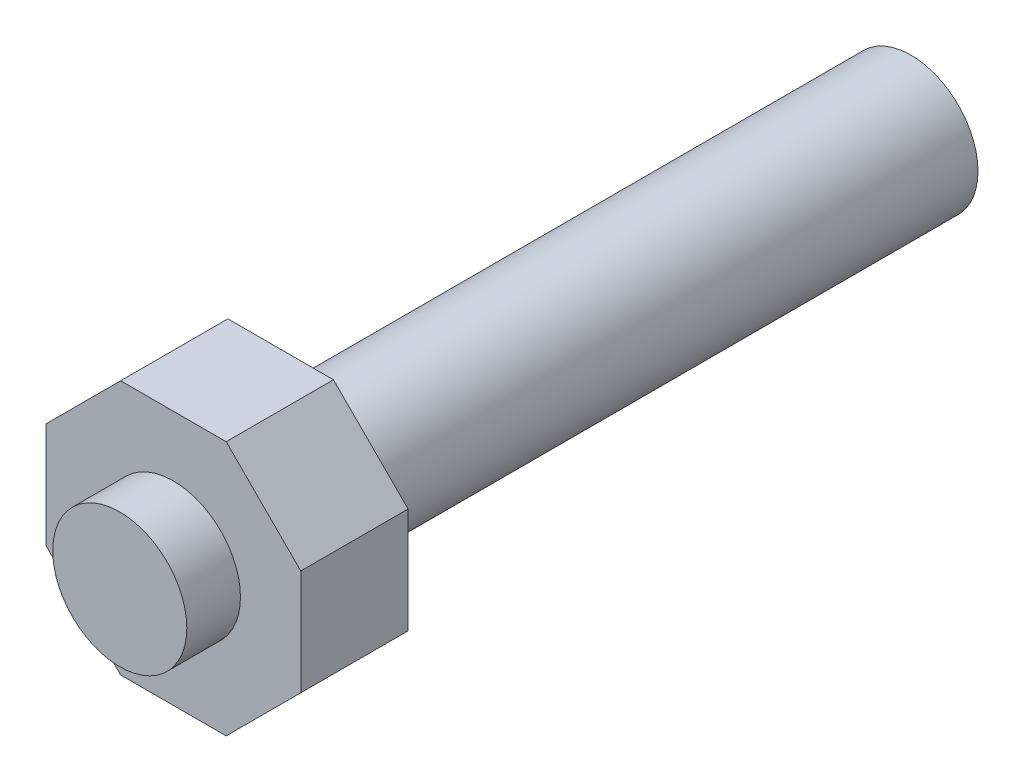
ISO-10303-21;
HEADER;
FILE_DESCRIPTION(('STEP AP214'),'2;1');
FILE_NAME('part.step','',(''),(''),'','','');
FILE_SCHEMA(('AUTOMOTIVE_DESIGN { 1 0 10303 214 1 1 1 1 }'));
ENDSEC;
DATA;
#1=APPLICATION_CONTEXT('core data for automotive mechanical design processes');
#2=APPLICATION_PROTOCOL_DEFINITION('international standard','automotive_design',2000,#1);
#3=PRODUCT_CONTEXT('',#1,'mechanical');
#4=PRODUCT('Part','Part','',(#3));
#5=PRODUCT_RELATED_PRODUCT_CATEGORY('part','',(#4));
#6=PRODUCT_DEFINITION_FORMATION('','',#4);
#7=PRODUCT_DEFINITION_CONTEXT('part definition',#1,'design');
#8=PRODUCT_DEFINITION('design','',#6,#7);
#9=PRODUCT_DEFINITION_SHAPE('','',#8);
#10=(LENGTH_UNIT() NAMED_UNIT(*) SI_UNIT(.MILLI.,.METRE.));
#11=(NAMED_UNIT(*) PLANE_ANGLE_UNIT() SI_UNIT($,.RADIAN.));
#12=(NAMED_UNIT(*) SI_UNIT($,.STERADIAN.) SOLID_ANGLE_UNIT());
#13=UNCERTAINTY_MEASURE_WITH_UNIT(LENGTH_MEASURE(1.E-05),#10,'distance_accuracy_value','');
#14=(GEOMETRIC_REPRESENTATION_CONTEXT(3) GLOBAL_UNCERTAINTY_ASSIGNED_CONTEXT((#13)) GLOBAL_UNIT_ASSIGNED_CONTEXT((#10,
#11,#12)) REPRESENTATION_CONTEXT('',''));
#15=CARTESIAN_POINT('',(0.,0.,0.));
#16=DIRECTION('',(0.,0.,1.));
#17=DIRECTION('',(1.,0.,0.));
#18=AXIS2_PLACEMENT_3D('',#15,#16,#17);
#19=CARTESIAN_POINT('',(5.,0.,47.));
#20=DIRECTION('',(0.,0.,1.));
#21=DIRECTION('',(1.,0.,0.));
#22=AXIS2_PLACEMENT_3D('',#19,#20,#21);
#23=PLANE('',#22);
#24=CARTESIAN_POINT('',(0.,0.,47.));
#25=DIRECTION('',(0.,0.,1.));
#26=DIRECTION('',(1.,0.,0.));
#27=AXIS2_PLACEMENT_3D('',#24,#25,#26);
#28=CIRCLE('',#27,5.);
#29=CARTESIAN_POINT('',(5.,0.,47.));
#30=VERTEX_POINT('',#29);
#31=EDGE_CURVE('E22',#30,#30,#28,.T.);
#32=ORIENTED_EDGE('',*,*,#31,.T.);
#33=EDGE_LOOP('',(#32));
#34=FACE_BOUND('',#33,.T.);
#35=DIRECTION('',(-0.707106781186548,-0.707106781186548,0.));
#36=VECTOR('',#35,1.);
#37=CARTESIAN_POINT('',(9.5,-3.9350288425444,47.));
#38=LINE('',#37,#36);
#39=CARTESIAN_POINT('',(9.5,-3.9350288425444,47.));
#40=VERTEX_POINT('',#39);
#41=CARTESIAN_POINT('',(3.9350288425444,-9.5,47.));
#42=VERTEX_POINT('',#41);
#43=EDGE_CURVE('E101',#40,#42,#38,.T.);
#44=ORIENTED_EDGE('',*,*,#43,.T.);
#45=DIRECTION('',(1.,0.,0.));
#46=VECTOR('',#45,1.);
#47=CARTESIAN_POINT('',(-3.9350288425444,-9.5,47.));
#48=LINE('',#47,#46);
#49=CARTESIAN_POINT('',(-3.9350288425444,-9.5,47.));
#50=VERTEX_POINT('',#49);
#51=EDGE_CURVE('E99',#50,#42,#48,.T.);
#52=ORIENTED_EDGE('',*,*,#51,.F.);
#53=DIRECTION('',(0.707106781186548,-0.707106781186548,0.));
#54=VECTOR('',#53,1.);
#55=CARTESIAN_POINT('',(-9.5,-3.9350288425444,47.));
#56=LINE('',#55,#54);
#57=CARTESIAN_POINT('',(-9.5,-3.9350288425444,47.));
#58=VERTEX_POINT('',#57);
#59=EDGE_CURVE('E29',#58,#50,#56,.T.);
#60=ORIENTED_EDGE('',*,*,#59,.F.);
#61=DIRECTION('',(0.,-1.,0.));
#62=VECTOR('',#61,1.);
#63=CARTESIAN_POINT('',(-9.5,3.9350288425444,47.));
#64=LINE('',#63,#62);
#65=CARTESIAN_POINT('',(-9.5,3.9350288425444,47.));
#66=VERTEX_POINT('',#65);
#67=EDGE_CURVE('E89',#66,#58,#64,.T.);
#68=ORIENTED_EDGE('',*,*,#67,.F.);
#69=DIRECTION('',(0.707106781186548,0.707106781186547,0.));
#70=VECTOR('',#69,1.);
#71=CARTESIAN_POINT('',(-9.5,3.9350288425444,47.));
#72=LINE('',#71,#70);
#73=CARTESIAN_POINT('',(-3.9350288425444,9.5,47.));
#74=VERTEX_POINT('',#73);
#75=EDGE_CURVE('E94',#66,#74,#72,.T.);
#76=ORIENTED_EDGE('',*,*,#75,.T.);
#77=DIRECTION('',(1.,0.,0.));
#78=VECTOR('',#77,1.);
#79=CARTESIAN_POINT('',(-3.9350288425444,9.5,47.));
#80=LINE('',#79,#78);
#81=CARTESIAN_POINT('',(3.9350288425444,9.5,47.));
#82=VERTEX_POINT('',#81);
#83=EDGE_CURVE('E216',#74,#82,#80,.T.);
#84=ORIENTED_EDGE('',*,*,#83,.T.);
#85=DIRECTION('',(0.707106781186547,-0.707106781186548,0.));
#86=VECTOR('',#85,1.);
#87=CARTESIAN_POINT('',(3.9350288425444,9.5,47.));
#88=LINE('',#87,#86);
#89=CARTESIAN_POINT('',(9.5,3.9350288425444,47.));
#90=VERTEX_POINT('',#89);
#91=EDGE_CURVE('E214',#82,#90,#88,.T.);
#92=ORIENTED_EDGE('',*,*,#91,.T.);
#93=DIRECTION('',(0.,-1.,0.));
#94=VECTOR('',#93,1.);
#95=CARTESIAN_POINT('',(9.5,3.9350288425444,47.));
#96=LINE('',#95,#94);
#97=EDGE_CURVE('E126',#90,#40,#96,.T.);
#98=ORIENTED_EDGE('',*,*,#97,.T.);
#99=EDGE_LOOP('',(#44,#52,#60,#68,#76,#84,#92,#98));
#100=FACE_BOUND('',#99,.T.);
#101=ADVANCED_FACE('F14',(#34,#100),#23,.F.);
#102=CARTESIAN_POINT('',(0.,0.,0.));
#103=DIRECTION('',(0.,0.,1.));
#104=DIRECTION('',(1.,0.,0.));
#105=AXIS2_PLACEMENT_3D('',#102,#103,#104);
#106=PLANE('',#105);
#107=CARTESIAN_POINT('',(0.,0.,0.));
#108=DIRECTION('',(0.,0.,1.));
#109=DIRECTION('',(1.,0.,0.));
#110=AXIS2_PLACEMENT_3D('',#107,#108,#109);
#111=CIRCLE('',#110,5.);
#112=CARTESIAN_POINT('',(5.,0.,0.));
#113=VERTEX_POINT('',#112);
#114=EDGE_CURVE('E9',#113,#113,#111,.T.);
#115=ORIENTED_EDGE('',*,*,#114,.F.);
#116=EDGE_LOOP('',(#115));
#117=FACE_BOUND('',#116,.T.);
#118=ADVANCED_FACE('F16',(#117),#106,.F.);
#119=CARTESIAN_POINT('',(0.,0.,80.));
#120=DIRECTION('',(0.,0.,1.));
#121=DIRECTION('',(1.,0.,0.));
#122=AXIS2_PLACEMENT_3D('',#119,#120,#121);
#123=CYLINDRICAL_SURFACE('',#122,5.);
#124=ORIENTED_EDGE('',*,*,#31,.F.);
#125=EDGE_LOOP('',(#124));
#126=FACE_BOUND('',#125,.T.);
#127=ORIENTED_EDGE('',*,*,#114,.T.);
#128=EDGE_LOOP('',(#127));
#129=FACE_BOUND('',#128,.T.);
#130=ADVANCED_FACE('F147',(#126,#129),#123,.T.);
#131=CARTESIAN_POINT('',(9.5,-3.9350288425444,55.));
#132=DIRECTION('',(0.707106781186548,-0.707106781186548,0.));
#133=DIRECTION('',(0.707106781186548,0.707106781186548,0.));
#134=AXIS2_PLACEMENT_3D('',#131,#132,#133);
#135=PLANE('',#134);
#136=DIRECTION('',(0.,0.,-1.));
#137=VECTOR('',#136,1.);
#138=CARTESIAN_POINT('',(9.5,-3.9350288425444,55.));
#139=LINE('',#138,#137);
#140=CARTESIAN_POINT('',(9.5,-3.9350288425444,55.));
#141=VERTEX_POINT('',#140);
#142=EDGE_CURVE('E136',#141,#40,#139,.T.);
#143=ORIENTED_EDGE('',*,*,#142,.F.);
#144=DIRECTION('',(-0.707106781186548,-0.707106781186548,0.));
#145=VECTOR('',#144,1.);
#146=CARTESIAN_POINT('',(9.5,-3.9350288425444,55.));
#147=LINE('',#146,#145);
#148=CARTESIAN_POINT('',(3.9350288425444,-9.5,55.));
#149=VERTEX_POINT('',#148);
#150=EDGE_CURVE('E37',#141,#149,#147,.T.);
#151=ORIENTED_EDGE('',*,*,#150,.T.);
#152=DIRECTION('',(0.,0.,-1.));
#153=VECTOR('',#152,1.);
#154=CARTESIAN_POINT('',(3.9350288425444,-9.5,55.));
#155=LINE('',#154,#153);
#156=EDGE_CURVE('E109',#149,#42,#155,.T.);
#157=ORIENTED_EDGE('',*,*,#156,.T.);
#158=ORIENTED_EDGE('',*,*,#43,.F.);
#159=EDGE_LOOP('',(#143,#151,#157,#158));
#160=FACE_BOUND('',#159,.T.);
#161=ADVANCED_FACE('F150',(#160),#135,.T.);
#162=CARTESIAN_POINT('',(9.5,3.9350288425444,55.));
#163=DIRECTION('',(1.,0.,0.));
#164=DIRECTION('',(0.,1.,0.));
#165=AXIS2_PLACEMENT_3D('',#162,#163,#164);
#166=PLANE('',#165);
#167=DIRECTION('',(0.,0.,-1.));
#168=VECTOR('',#167,1.);
#169=CARTESIAN_POINT('',(9.5,3.9350288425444,55.));
#170=LINE('',#169,#168);
#171=CARTESIAN_POINT('',(9.5,3.9350288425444,55.));
#172=VERTEX_POINT('',#171);
#173=EDGE_CURVE('E134',#172,#90,#170,.T.);
#174=ORIENTED_EDGE('',*,*,#173,.F.);
#175=DIRECTION('',(0.,-1.,0.));
#176=VECTOR('',#175,1.);
#177=CARTESIAN_POINT('',(9.5,3.9350288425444,55.));
#178=LINE('',#177,#176);
#179=EDGE_CURVE('E106',#172,#141,#178,.T.);
#180=ORIENTED_EDGE('',*,*,#179,.T.);
#181=ORIENTED_EDGE('',*,*,#142,.T.);
#182=ORIENTED_EDGE('',*,*,#97,.F.);
#183=EDGE_LOOP('',(#174,#180,#181,#182));
#184=FACE_BOUND('',#183,.T.);
#185=ADVANCED_FACE('F177',(#184),#166,.T.);
#186=CARTESIAN_POINT('',(3.9350288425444,9.5,55.));
#187=DIRECTION('',(0.707106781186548,0.707106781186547,0.));
#188=DIRECTION('',(-0.707106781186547,0.707106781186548,0.));
#189=AXIS2_PLACEMENT_3D('',#186,#187,#188);
#190=PLANE('',#189);
#191=DIRECTION('',(0.,0.,-1.));
#192=VECTOR('',#191,1.);
#193=CARTESIAN_POINT('',(3.9350288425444,9.5,55.));
#194=LINE('',#193,#192);
#195=CARTESIAN_POINT('',(3.9350288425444,9.5,55.));
#196=VERTEX_POINT('',#195);
#197=EDGE_CURVE('E132',#196,#82,#194,.T.);
#198=ORIENTED_EDGE('',*,*,#197,.F.);
#199=DIRECTION('',(0.707106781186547,-0.707106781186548,0.));
#200=VECTOR('',#199,1.);
#201=CARTESIAN_POINT('',(3.9350288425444,9.5,55.));
#202=LINE('',#201,#200);
#203=EDGE_CURVE('E110',#196,#172,#202,.T.);
#204=ORIENTED_EDGE('',*,*,#203,.T.);
#205=ORIENTED_EDGE('',*,*,#173,.T.);
#206=ORIENTED_EDGE('',*,*,#91,.F.);
#207=EDGE_LOOP('',(#198,#204,#205,#206));
#208=FACE_BOUND('',#207,.T.);
#209=ADVANCED_FACE('F180',(#208),#190,.T.);
#210=CARTESIAN_POINT('',(-3.9350288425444,9.5,55.));
#211=DIRECTION('',(0.,1.,0.));
#212=DIRECTION('',(0.,0.,1.));
#213=AXIS2_PLACEMENT_3D('',#210,#211,#212);
#214=PLANE('',#213);
#215=DIRECTION('',(0.,0.,-1.));
#216=VECTOR('',#215,1.);
#217=CARTESIAN_POINT('',(-3.9350288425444,9.5,55.));
#218=LINE('',#217,#216);
#219=CARTESIAN_POINT('',(-3.9350288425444,9.5,55.));
#220=VERTEX_POINT('',#219);
#221=EDGE_CURVE('E130',#220,#74,#218,.T.);
#222=ORIENTED_EDGE('',*,*,#221,.F.);
#223=DIRECTION('',(1.,0.,0.));
#224=VECTOR('',#223,1.);
#225=CARTESIAN_POINT('',(-3.9350288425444,9.5,55.));
#226=LINE('',#225,#224);
#227=EDGE_CURVE('E113',#220,#196,#226,.T.);
#228=ORIENTED_EDGE('',*,*,#227,.T.);
#229=ORIENTED_EDGE('',*,*,#197,.T.);
#230=ORIENTED_EDGE('',*,*,#83,.F.);
#231=EDGE_LOOP('',(#222,#228,#229,#230));
#232=FACE_BOUND('',#231,.T.);
#233=ADVANCED_FACE('F184',(#232),#214,.T.);
#234=CARTESIAN_POINT('',(-9.5,3.9350288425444,55.));
#235=DIRECTION('',(-0.707106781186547,0.707106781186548,0.));
#236=DIRECTION('',(-0.707106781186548,-0.707106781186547,0.));
#237=AXIS2_PLACEMENT_3D('',#234,#235,#236);
#238=PLANE('',#237);
#239=DIRECTION('',(0.,0.,-1.));
#240=VECTOR('',#239,1.);
#241=CARTESIAN_POINT('',(-9.5,3.9350288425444,55.));
#242=LINE('',#241,#240);
#243=CARTESIAN_POINT('',(-9.5,3.9350288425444,55.));
#244=VERTEX_POINT('',#243);
#245=EDGE_CURVE('E85',#244,#66,#242,.T.);
#246=ORIENTED_EDGE('',*,*,#245,.F.);
#247=DIRECTION('',(0.707106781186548,0.707106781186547,0.));
#248=VECTOR('',#247,1.);
#249=CARTESIAN_POINT('',(-9.5,3.9350288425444,55.));
#250=LINE('',#249,#248);
#251=EDGE_CURVE('E116',#244,#220,#250,.T.);
#252=ORIENTED_EDGE('',*,*,#251,.T.);
#253=ORIENTED_EDGE('',*,*,#221,.T.);
#254=ORIENTED_EDGE('',*,*,#75,.F.);
#255=EDGE_LOOP('',(#246,#252,#253,#254));
#256=FACE_BOUND('',#255,.T.);
#257=ADVANCED_FACE('F188',(#256),#238,.T.);
#258=CARTESIAN_POINT('',(-9.5,3.9350288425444,55.));
#259=DIRECTION('',(1.,0.,0.));
#260=DIRECTION('',(0.,1.,0.));
#261=AXIS2_PLACEMENT_3D('',#258,#259,#260);
#262=PLANE('',#261);
#263=DIRECTION('',(0.,0.,-1.));
#264=VECTOR('',#263,1.);
#265=CARTESIAN_POINT('',(-9.5,-3.9350288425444,55.));
#266=LINE('',#265,#264);
#267=CARTESIAN_POINT('',(-9.5,-3.9350288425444,55.));
#268=VERTEX_POINT('',#267);
#269=EDGE_CURVE('E77',#268,#58,#266,.T.);
#270=ORIENTED_EDGE('',*,*,#269,.F.);
#271=DIRECTION('',(0.,-1.,0.));
#272=VECTOR('',#271,1.);
#273=CARTESIAN_POINT('',(-9.5,3.9350288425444,55.));
#274=LINE('',#273,#272);
#275=EDGE_CURVE('E119',#244,#268,#274,.T.);
#276=ORIENTED_EDGE('',*,*,#275,.F.);
#277=ORIENTED_EDGE('',*,*,#245,.T.);
#278=ORIENTED_EDGE('',*,*,#67,.T.);
#279=EDGE_LOOP('',(#270,#276,#277,#278));
#280=FACE_BOUND('',#279,.T.);
#281=ADVANCED_FACE('F90',(#280),#262,.F.);
#282=CARTESIAN_POINT('',(-9.5,-3.9350288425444,55.));
#283=DIRECTION('',(0.707106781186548,0.707106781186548,0.));
#284=DIRECTION('',(-0.707106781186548,0.707106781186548,0.));
#285=AXIS2_PLACEMENT_3D('',#282,#283,#284);
#286=PLANE('',#285);
#287=DIRECTION('',(0.,0.,-1.));
#288=VECTOR('',#287,1.);
#289=CARTESIAN_POINT('',(-3.9350288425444,-9.5,55.));
#290=LINE('',#289,#288);
#291=CARTESIAN_POINT('',(-3.9350288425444,-9.5,55.));
#292=VERTEX_POINT('',#291);
#293=EDGE_CURVE('E86',#292,#50,#290,.T.);
#294=ORIENTED_EDGE('',*,*,#293,.F.);
#295=DIRECTION('',(0.707106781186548,-0.707106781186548,0.));
#296=VECTOR('',#295,1.);
#297=CARTESIAN_POINT('',(-9.5,-3.9350288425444,55.));
#298=LINE('',#297,#296);
#299=EDGE_CURVE('E81',#268,#292,#298,.T.);
#300=ORIENTED_EDGE('',*,*,#299,.F.);
#301=ORIENTED_EDGE('',*,*,#269,.T.);
#302=ORIENTED_EDGE('',*,*,#59,.T.);
#303=EDGE_LOOP('',(#294,#300,#301,#302));
#304=FACE_BOUND('',#303,.T.);
#305=ADVANCED_FACE('F79',(#304),#286,.F.);
#306=CARTESIAN_POINT('',(-3.9350288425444,-9.5,55.));
#307=DIRECTION('',(0.,1.,0.));
#308=DIRECTION('',(0.,0.,1.));
#309=AXIS2_PLACEMENT_3D('',#306,#307,#308);
#310=PLANE('',#309);
#311=DIRECTION('',(1.,0.,0.));
#312=VECTOR('',#311,1.);
#313=CARTESIAN_POINT('',(-3.9350288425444,-9.5,55.));
#314=LINE('',#313,#312);
#315=EDGE_CURVE('E122',#292,#149,#314,.T.);
#316=ORIENTED_EDGE('',*,*,#315,.F.);
#317=ORIENTED_EDGE('',*,*,#293,.T.);
#318=ORIENTED_EDGE('',*,*,#51,.T.);
#319=ORIENTED_EDGE('',*,*,#156,.F.);
#320=EDGE_LOOP('',(#316,#317,#318,#319));
#321=FACE_BOUND('',#320,.T.);
#322=ADVANCED_FACE('F175',(#321),#310,.F.);
#323=CARTESIAN_POINT('',(5.,0.,59.));
#324=DIRECTION('',(0.,0.,-1.));
#325=DIRECTION('',(-1.,0.,0.));
#326=AXIS2_PLACEMENT_3D('',#323,#324,#325);
#327=PLANE('',#326);
#328=CARTESIAN_POINT('',(0.,0.,59.));
#329=DIRECTION('',(0.,0.,1.));
#330=DIRECTION('',(1.,0.,0.));
#331=AXIS2_PLACEMENT_3D('',#328,#329,#330);
#332=CIRCLE('',#331,5.);
#333=CARTESIAN_POINT('',(5.,0.,59.));
#334=VERTEX_POINT('',#333);
#335=EDGE_CURVE('E138',#334,#334,#332,.T.);
#336=ORIENTED_EDGE('',*,*,#335,.T.);
#337=EDGE_LOOP('',(#336));
#338=FACE_BOUND('',#337,.T.);
#339=ADVANCED_FACE('F171',(#338),#327,.F.);
#340=CARTESIAN_POINT('',(0.,0.,80.));
#341=DIRECTION('',(0.,0.,1.));
#342=DIRECTION('',(1.,0.,0.));
#343=AXIS2_PLACEMENT_3D('',#340,#341,#342);
#344=CYLINDRICAL_SURFACE('',#343,5.);
#345=ORIENTED_EDGE('',*,*,#335,.F.);
#346=EDGE_LOOP('',(#345));
#347=FACE_BOUND('',#346,.T.);
#348=CARTESIAN_POINT('',(0.,0.,55.));
#349=DIRECTION('',(0.,0.,1.));
#350=DIRECTION('',(1.,0.,0.));
#351=AXIS2_PLACEMENT_3D('',#348,#349,#350);
#352=CIRCLE('',#351,5.);
#353=CARTESIAN_POINT('',(5.,0.,55.));
#354=VERTEX_POINT('',#353);
#355=EDGE_CURVE('E141',#354,#354,#352,.T.);
#356=ORIENTED_EDGE('',*,*,#355,.T.);
#357=EDGE_LOOP('',(#356));
#358=FACE_BOUND('',#357,.T.);
#359=ADVANCED_FACE('F167',(#347,#358),#344,.T.);
#360=CARTESIAN_POINT('',(11.,0.,55.));
#361=DIRECTION('',(0.,0.,-1.));
#362=DIRECTION('',(-1.,0.,0.));
#363=AXIS2_PLACEMENT_3D('',#360,#361,#362);
#364=PLANE('',#363);
#365=ORIENTED_EDGE('',*,*,#355,.F.);
#366=EDGE_LOOP('',(#365));
#367=FACE_BOUND('',#366,.T.);
#368=ORIENTED_EDGE('',*,*,#150,.F.);
#369=ORIENTED_EDGE('',*,*,#179,.F.);
#370=ORIENTED_EDGE('',*,*,#203,.F.);
#371=ORIENTED_EDGE('',*,*,#227,.F.);
#372=ORIENTED_EDGE('',*,*,#251,.F.);
#373=ORIENTED_EDGE('',*,*,#275,.T.);
#374=ORIENTED_EDGE('',*,*,#299,.T.);
#375=ORIENTED_EDGE('',*,*,#315,.T.);
#376=EDGE_LOOP('',(#368,#369,#370,#371,#372,#373,#374,#375));
#377=FACE_BOUND('',#376,.T.);
#378=ADVANCED_FACE('F164',(#367,#377),#364,.F.);
#379=CLOSED_SHELL('',(#101,#118,#130,#161,#185,#209,#233,#257,#281,#305,#322,#339,#359,#378));
#380=MANIFOLD_SOLID_BREP('B1',#379);
#381=ADVANCED_BREP_SHAPE_REPRESENTATION('',(#18,#380),#14);
#382=SHAPE_DEFINITION_REPRESENTATION(#9,#381);
ENDSEC;
END-ISO-10303-21;
